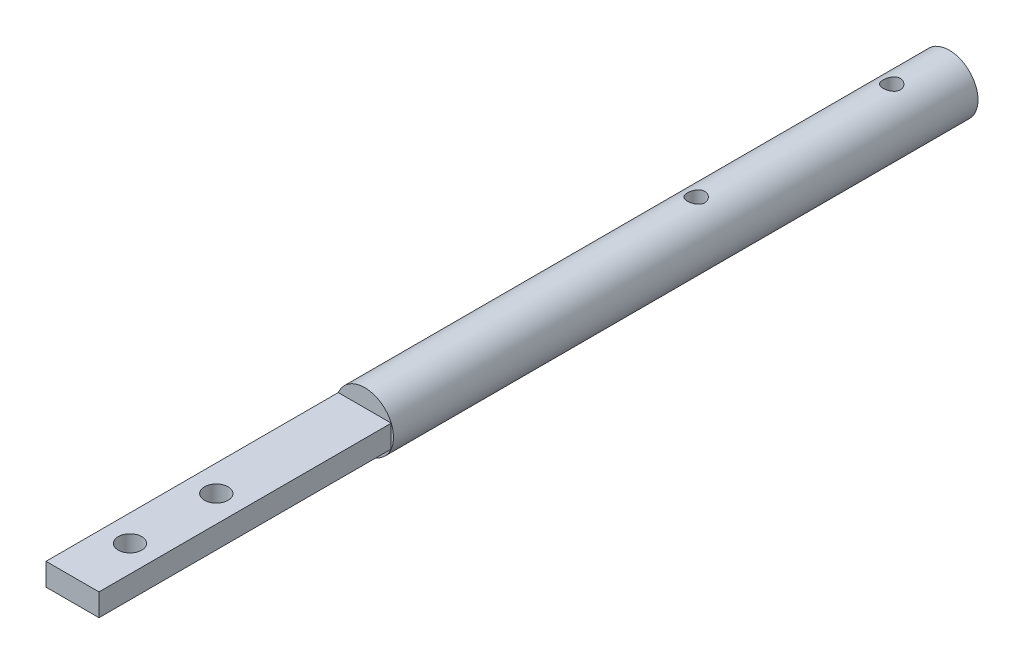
from build123d import *

# Parameters (mm, degrees)
SKETCH1_R               = 2.5
BOSS_EXTRUDE1_DEPTH     = 50.8
SKETCH2_W               = 4.604836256
SKETCH2_H               = 1.948199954
BOSS_EXTRUDE2_DEPTH     = 25.4
SKETCH3_R               = 1.022717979
CUT_EXTRUDE1_DEPTH      = 77.320111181
CUT_EXTRUDE2_DEPTH      = 77.281976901
CUT_EXTRUDE2_DEPTH_BACK = 77.281976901
SKETCH4_R               = 0.75


with BuildPart() as part:
    # Sketch1 → Boss-Extrude1 (new body)
    with BuildSketch(Plane.XY):
        Circle(SKETCH1_R)
    extrude(amount=BOSS_EXTRUDE1_DEPTH)

    # Sketch2 → Boss-Extrude2 (add)
    with BuildSketch(Plane.XY.offset(50.8)):
        Rectangle(SKETCH2_W, SKETCH2_H)
    extrude(amount=BOSS_EXTRUDE2_DEPTH)

    # Sketch3 → Cut-Extrude1 (cut, through all)
    with BuildSketch(Plane(origin=(0, 0.974099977, 0), x_dir=(1, 0, 0), z_dir=(0, 1, 0))):
        with Locations(Location((0, -63.7, 0), (0, 0, 270))):
            Circle(SKETCH3_R)
        with Locations(Location((0, -71.2, 0), (0, 0, 270))):
            Circle(SKETCH3_R)
    extrude(amount=-CUT_EXTRUDE1_DEPTH, mode=Mode.SUBTRACT)

    # Sketch4 → Cut-Extrude2 (cut, two sides: drawn at the far end of the back side and taken through both)
    with BuildSketch(Plane(origin=(0, 0, 0), x_dir=(1, 0, 0), z_dir=(0, 1, 0)).offset(-CUT_EXTRUDE2_DEPTH_BACK)):
        with Locations(Location((0, -5, 0), (0, 0, 270))):
            Circle(SKETCH4_R)
        with Locations(Location((0, -22, 0), (0, 0, 270))):
            Circle(SKETCH4_R)
    extrude(amount=CUT_EXTRUDE2_DEPTH + CUT_EXTRUDE2_DEPTH_BACK, mode=Mode.SUBTRACT)


solid = part.part
